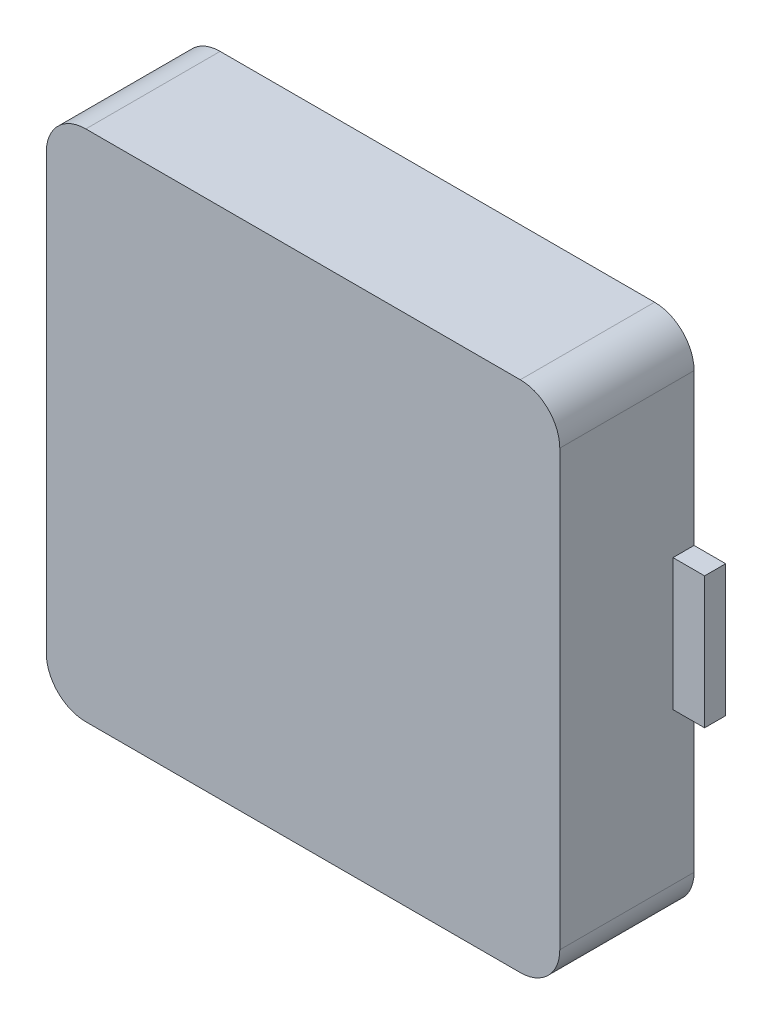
ISO-10303-21;
HEADER;
FILE_DESCRIPTION(('STEP AP214'),'2;1');
FILE_NAME('part.step','',(''),(''),'','','');
FILE_SCHEMA(('AUTOMOTIVE_DESIGN { 1 0 10303 214 1 1 1 1 }'));
ENDSEC;
DATA;
#1=APPLICATION_CONTEXT('core data for automotive mechanical design processes');
#2=APPLICATION_PROTOCOL_DEFINITION('international standard','automotive_design',2000,#1);
#3=PRODUCT_CONTEXT('',#1,'mechanical');
#4=PRODUCT('Part','Part','',(#3));
#5=PRODUCT_RELATED_PRODUCT_CATEGORY('part','',(#4));
#6=PRODUCT_DEFINITION_FORMATION('','',#4);
#7=PRODUCT_DEFINITION_CONTEXT('part definition',#1,'design');
#8=PRODUCT_DEFINITION('design','',#6,#7);
#9=PRODUCT_DEFINITION_SHAPE('','',#8);
#10=(LENGTH_UNIT() NAMED_UNIT(*) SI_UNIT(.MILLI.,.METRE.));
#11=(NAMED_UNIT(*) PLANE_ANGLE_UNIT() SI_UNIT($,.RADIAN.));
#12=(NAMED_UNIT(*) SI_UNIT($,.STERADIAN.) SOLID_ANGLE_UNIT());
#13=UNCERTAINTY_MEASURE_WITH_UNIT(LENGTH_MEASURE(1.E-05),#10,'distance_accuracy_value','');
#14=(GEOMETRIC_REPRESENTATION_CONTEXT(3) GLOBAL_UNCERTAINTY_ASSIGNED_CONTEXT((#13)) GLOBAL_UNIT_ASSIGNED_CONTEXT((#10,
#11,#12)) REPRESENTATION_CONTEXT('',''));
#15=CARTESIAN_POINT('',(0.,0.,0.));
#16=DIRECTION('',(0.,0.,1.));
#17=DIRECTION('',(1.,0.,0.));
#18=AXIS2_PLACEMENT_3D('',#15,#16,#17);
#19=CARTESIAN_POINT('',(0.,0.,0.));
#20=DIRECTION('',(0.,0.,-1.));
#21=DIRECTION('',(-1.,0.,0.));
#22=AXIS2_PLACEMENT_3D('',#19,#20,#21);
#23=CONICAL_SURFACE('',#22,3.15,0.0222185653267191);
#24=CARTESIAN_POINT('',(0.,0.,-4.5));
#25=DIRECTION('',(0.,0.,1.));
#26=DIRECTION('',(1.,0.,0.));
#27=AXIS2_PLACEMENT_3D('',#24,#25,#26);
#28=CIRCLE('',#27,3.25);
#29=CARTESIAN_POINT('',(3.25,0.,-4.5));
#30=VERTEX_POINT('',#29);
#31=EDGE_CURVE('E283',#30,#30,#28,.T.);
#32=ORIENTED_EDGE('',*,*,#31,.F.);
#33=EDGE_LOOP('',(#32));
#34=FACE_BOUND('',#33,.T.);
#35=CARTESIAN_POINT('',(0.,0.,0.));
#36=DIRECTION('',(0.,0.,1.));
#37=DIRECTION('',(1.,0.,0.));
#38=AXIS2_PLACEMENT_3D('',#35,#36,#37);
#39=CIRCLE('',#38,3.15);
#40=CARTESIAN_POINT('',(3.15,0.,0.));
#41=VERTEX_POINT('',#40);
#42=EDGE_CURVE('E286',#41,#41,#39,.T.);
#43=ORIENTED_EDGE('',*,*,#42,.T.);
#44=EDGE_LOOP('',(#43));
#45=FACE_BOUND('',#44,.T.);
#46=ADVANCED_FACE('F37',(#34,#45),#23,.F.);
#47=CARTESIAN_POINT('',(0.,3.25,-4.5));
#48=DIRECTION('',(0.,0.,1.));
#49=DIRECTION('',(1.,0.,0.));
#50=AXIS2_PLACEMENT_3D('',#47,#48,#49);
#51=PLANE('',#50);
#52=DIRECTION('',(0.,-1.,0.));
#53=VECTOR('',#52,1.);
#54=CARTESIAN_POINT('',(9.75,9.75,-4.5));
#55=LINE('',#54,#53);
#56=CARTESIAN_POINT('',(9.75,8.25,-4.5));
#57=VERTEX_POINT('',#56);
#58=CARTESIAN_POINT('',(9.75,2.5,-4.5));
#59=VERTEX_POINT('',#58);
#60=EDGE_CURVE('E270',#57,#59,#55,.T.);
#61=ORIENTED_EDGE('',*,*,#60,.T.);
#62=DIRECTION('',(1.,0.,0.));
#63=VECTOR('',#62,1.);
#64=CARTESIAN_POINT('',(9.75,2.5,-4.5));
#65=LINE('',#64,#63);
#66=CARTESIAN_POINT('',(10.95,2.5,-4.5));
#67=VERTEX_POINT('',#66);
#68=EDGE_CURVE('E233',#59,#67,#65,.T.);
#69=ORIENTED_EDGE('',*,*,#68,.T.);
#70=DIRECTION('',(0.,-1.,0.));
#71=VECTOR('',#70,1.);
#72=CARTESIAN_POINT('',(10.95,2.5,-4.5));
#73=LINE('',#72,#71);
#74=CARTESIAN_POINT('',(10.95,-2.5,-4.5));
#75=VERTEX_POINT('',#74);
#76=EDGE_CURVE('E256',#67,#75,#73,.T.);
#77=ORIENTED_EDGE('',*,*,#76,.T.);
#78=DIRECTION('',(-1.,0.,0.));
#79=VECTOR('',#78,1.);
#80=CARTESIAN_POINT('',(9.75,-2.5,-4.5));
#81=LINE('',#80,#79);
#82=CARTESIAN_POINT('',(9.75,-2.5,-4.5));
#83=VERTEX_POINT('',#82);
#84=EDGE_CURVE('E244',#75,#83,#81,.T.);
#85=ORIENTED_EDGE('',*,*,#84,.T.);
#86=CARTESIAN_POINT('',(9.75,-8.25,-4.5));
#87=VERTEX_POINT('',#86);
#88=EDGE_CURVE('E263',#83,#87,#55,.T.);
#89=ORIENTED_EDGE('',*,*,#88,.T.);
#90=CARTESIAN_POINT('',(8.25,-8.25,-4.5));
#91=DIRECTION('',(0.,0.,1.));
#92=DIRECTION('',(1.,0.,0.));
#93=AXIS2_PLACEMENT_3D('',#90,#91,#92);
#94=CIRCLE('',#93,1.5);
#95=CARTESIAN_POINT('',(8.25,-9.75,-4.5));
#96=VERTEX_POINT('',#95);
#97=EDGE_CURVE('E312',#87,#96,#94,.F.);
#98=ORIENTED_EDGE('',*,*,#97,.T.);
#99=DIRECTION('',(-1.,0.,0.));
#100=VECTOR('',#99,1.);
#101=CARTESIAN_POINT('',(9.75,-9.75,-4.5));
#102=LINE('',#101,#100);
#103=CARTESIAN_POINT('',(-8.25,-9.75,-4.5));
#104=VERTEX_POINT('',#103);
#105=EDGE_CURVE('E273',#96,#104,#102,.T.);
#106=ORIENTED_EDGE('',*,*,#105,.T.);
#107=CARTESIAN_POINT('',(-8.25,-8.25,-4.5));
#108=DIRECTION('',(0.,0.,1.));
#109=DIRECTION('',(1.,0.,0.));
#110=AXIS2_PLACEMENT_3D('',#107,#108,#109);
#111=CIRCLE('',#110,1.5);
#112=CARTESIAN_POINT('',(-9.75,-8.25,-4.5));
#113=VERTEX_POINT('',#112);
#114=EDGE_CURVE('E310',#104,#113,#111,.F.);
#115=ORIENTED_EDGE('',*,*,#114,.T.);
#116=DIRECTION('',(0.,1.,0.));
#117=VECTOR('',#116,1.);
#118=CARTESIAN_POINT('',(-9.75,-9.75,-4.5));
#119=LINE('',#118,#117);
#120=CARTESIAN_POINT('',(-9.75,-7.5,-4.5));
#121=VERTEX_POINT('',#120);
#122=EDGE_CURVE('E277',#113,#121,#119,.T.);
#123=ORIENTED_EDGE('',*,*,#122,.T.);
#124=DIRECTION('',(-1.,0.,0.));
#125=VECTOR('',#124,1.);
#126=CARTESIAN_POINT('',(-9.75,-7.5,-4.5));
#127=LINE('',#126,#125);
#128=CARTESIAN_POINT('',(-10.95,-7.5,-4.5));
#129=VERTEX_POINT('',#128);
#130=EDGE_CURVE('E179',#121,#129,#127,.T.);
#131=ORIENTED_EDGE('',*,*,#130,.T.);
#132=DIRECTION('',(0.,1.,0.));
#133=VECTOR('',#132,1.);
#134=CARTESIAN_POINT('',(-10.95,-3.5,-4.5));
#135=LINE('',#134,#133);
#136=CARTESIAN_POINT('',(-10.95,-3.5,-4.5));
#137=VERTEX_POINT('',#136);
#138=EDGE_CURVE('E201',#129,#137,#135,.T.);
#139=ORIENTED_EDGE('',*,*,#138,.T.);
#140=DIRECTION('',(1.,0.,0.));
#141=VECTOR('',#140,1.);
#142=CARTESIAN_POINT('',(-9.75,-3.5,-4.5));
#143=LINE('',#142,#141);
#144=CARTESIAN_POINT('',(-9.75,-3.5,-4.5));
#145=VERTEX_POINT('',#144);
#146=EDGE_CURVE('E52',#137,#145,#143,.T.);
#147=ORIENTED_EDGE('',*,*,#146,.T.);
#148=CARTESIAN_POINT('',(-9.75,3.5,-4.5));
#149=VERTEX_POINT('',#148);
#150=EDGE_CURVE('E280',#145,#149,#119,.T.);
#151=ORIENTED_EDGE('',*,*,#150,.T.);
#152=DIRECTION('',(-1.,0.,0.));
#153=VECTOR('',#152,1.);
#154=CARTESIAN_POINT('',(-9.75,3.5,-4.5));
#155=LINE('',#154,#153);
#156=CARTESIAN_POINT('',(-10.95,3.5,-4.5));
#157=VERTEX_POINT('',#156);
#158=EDGE_CURVE('E209',#149,#157,#155,.T.);
#159=ORIENTED_EDGE('',*,*,#158,.T.);
#160=DIRECTION('',(0.,1.,0.));
#161=VECTOR('',#160,1.);
#162=CARTESIAN_POINT('',(-10.95,7.5,-4.5));
#163=LINE('',#162,#161);
#164=CARTESIAN_POINT('',(-10.95,7.5,-4.5));
#165=VERTEX_POINT('',#164);
#166=EDGE_CURVE('E228',#157,#165,#163,.T.);
#167=ORIENTED_EDGE('',*,*,#166,.T.);
#168=DIRECTION('',(1.,0.,0.));
#169=VECTOR('',#168,1.);
#170=CARTESIAN_POINT('',(-9.75,7.5,-4.5));
#171=LINE('',#170,#169);
#172=CARTESIAN_POINT('',(-9.75,7.5,-4.5));
#173=VERTEX_POINT('',#172);
#174=EDGE_CURVE('E59',#165,#173,#171,.T.);
#175=ORIENTED_EDGE('',*,*,#174,.T.);
#176=CARTESIAN_POINT('',(-9.75,8.25,-4.5));
#177=VERTEX_POINT('',#176);
#178=EDGE_CURVE('E276',#173,#177,#119,.T.);
#179=ORIENTED_EDGE('',*,*,#178,.T.);
#180=CARTESIAN_POINT('',(-8.25,8.25,-4.5));
#181=DIRECTION('',(0.,0.,1.));
#182=DIRECTION('',(1.,0.,0.));
#183=AXIS2_PLACEMENT_3D('',#180,#181,#182);
#184=CIRCLE('',#183,1.5);
#185=CARTESIAN_POINT('',(-8.25,9.75,-4.5));
#186=VERTEX_POINT('',#185);
#187=EDGE_CURVE('E308',#177,#186,#184,.F.);
#188=ORIENTED_EDGE('',*,*,#187,.T.);
#189=DIRECTION('',(1.,0.,0.));
#190=VECTOR('',#189,1.);
#191=CARTESIAN_POINT('',(-9.75,9.75,-4.5));
#192=LINE('',#191,#190);
#193=CARTESIAN_POINT('',(8.25,9.75,-4.5));
#194=VERTEX_POINT('',#193);
#195=EDGE_CURVE('E279',#186,#194,#192,.T.);
#196=ORIENTED_EDGE('',*,*,#195,.T.);
#197=CARTESIAN_POINT('',(8.25,8.25,-4.5));
#198=DIRECTION('',(0.,0.,1.));
#199=DIRECTION('',(1.,0.,0.));
#200=AXIS2_PLACEMENT_3D('',#197,#198,#199);
#201=CIRCLE('',#200,1.5);
#202=EDGE_CURVE('E306',#194,#57,#201,.F.);
#203=ORIENTED_EDGE('',*,*,#202,.T.);
#204=EDGE_LOOP('',(#61,#69,#77,#85,#89,#98,#106,#115,#123,#131,#139,#147,#151,#159,#167,#175,
#179,#188,#196,#203));
#205=FACE_BOUND('',#204,.T.);
#206=ORIENTED_EDGE('',*,*,#31,.T.);
#207=EDGE_LOOP('',(#206));
#208=FACE_BOUND('',#207,.T.);
#209=ADVANCED_FACE('F340',(#205,#208),#51,.F.);
#210=CARTESIAN_POINT('',(0.,0.,0.));
#211=DIRECTION('',(0.,0.,-1.));
#212=DIRECTION('',(-1.,0.,0.));
#213=AXIS2_PLACEMENT_3D('',#210,#211,#212);
#214=PLANE('',#213);
#215=ORIENTED_EDGE('',*,*,#42,.F.);
#216=EDGE_LOOP('',(#215));
#217=FACE_BOUND('',#216,.T.);
#218=ADVANCED_FACE('F389',(#217),#214,.T.);
#219=CARTESIAN_POINT('',(0.,0.,0.6));
#220=DIRECTION('',(0.,0.,-1.));
#221=DIRECTION('',(-1.,0.,0.));
#222=AXIS2_PLACEMENT_3D('',#219,#220,#221);
#223=PLANE('',#222);
#224=DIRECTION('',(1.,0.,0.));
#225=VECTOR('',#224,1.);
#226=CARTESIAN_POINT('',(-9.75,-9.75,0.6));
#227=LINE('',#226,#225);
#228=CARTESIAN_POINT('',(-8.25,-9.75,0.6));
#229=VERTEX_POINT('',#228);
#230=CARTESIAN_POINT('',(8.25,-9.75,0.6));
#231=VERTEX_POINT('',#230);
#232=EDGE_CURVE('E298',#229,#231,#227,.T.);
#233=ORIENTED_EDGE('',*,*,#232,.T.);
#234=CARTESIAN_POINT('',(8.25,-8.25,0.6));
#235=DIRECTION('',(0.,0.,-1.));
#236=DIRECTION('',(-1.,0.,0.));
#237=AXIS2_PLACEMENT_3D('',#234,#235,#236);
#238=CIRCLE('',#237,1.5);
#239=CARTESIAN_POINT('',(9.75,-8.25,0.6));
#240=VERTEX_POINT('',#239);
#241=EDGE_CURVE('E325',#231,#240,#238,.F.);
#242=ORIENTED_EDGE('',*,*,#241,.T.);
#243=DIRECTION('',(0.,1.,0.));
#244=VECTOR('',#243,1.);
#245=CARTESIAN_POINT('',(9.75,-9.75,0.6));
#246=LINE('',#245,#244);
#247=CARTESIAN_POINT('',(9.75,8.25,0.6));
#248=VERTEX_POINT('',#247);
#249=EDGE_CURVE('E289',#240,#248,#246,.T.);
#250=ORIENTED_EDGE('',*,*,#249,.T.);
#251=CARTESIAN_POINT('',(8.25,8.25,0.6));
#252=DIRECTION('',(0.,0.,-1.));
#253=DIRECTION('',(-1.,0.,0.));
#254=AXIS2_PLACEMENT_3D('',#251,#252,#253);
#255=CIRCLE('',#254,1.5);
#256=CARTESIAN_POINT('',(8.25,9.75,0.6));
#257=VERTEX_POINT('',#256);
#258=EDGE_CURVE('E319',#248,#257,#255,.F.);
#259=ORIENTED_EDGE('',*,*,#258,.T.);
#260=DIRECTION('',(-1.,0.,0.));
#261=VECTOR('',#260,1.);
#262=CARTESIAN_POINT('',(-9.75,9.75,0.6));
#263=LINE('',#262,#261);
#264=CARTESIAN_POINT('',(-8.25,9.75,0.6));
#265=VERTEX_POINT('',#264);
#266=EDGE_CURVE('E292',#257,#265,#263,.T.);
#267=ORIENTED_EDGE('',*,*,#266,.T.);
#268=CARTESIAN_POINT('',(-8.25,8.25,0.6));
#269=DIRECTION('',(0.,0.,-1.));
#270=DIRECTION('',(-1.,0.,0.));
#271=AXIS2_PLACEMENT_3D('',#268,#269,#270);
#272=CIRCLE('',#271,1.5);
#273=CARTESIAN_POINT('',(-9.75,8.25,0.6));
#274=VERTEX_POINT('',#273);
#275=EDGE_CURVE('E321',#265,#274,#272,.F.);
#276=ORIENTED_EDGE('',*,*,#275,.T.);
#277=DIRECTION('',(0.,-1.,0.));
#278=VECTOR('',#277,1.);
#279=CARTESIAN_POINT('',(-9.75,-9.75,0.6));
#280=LINE('',#279,#278);
#281=CARTESIAN_POINT('',(-9.75,-8.25,0.6));
#282=VERTEX_POINT('',#281);
#283=EDGE_CURVE('E295',#274,#282,#280,.T.);
#284=ORIENTED_EDGE('',*,*,#283,.T.);
#285=CARTESIAN_POINT('',(-8.25,-8.25,0.6));
#286=DIRECTION('',(0.,0.,-1.));
#287=DIRECTION('',(-1.,0.,0.));
#288=AXIS2_PLACEMENT_3D('',#285,#286,#287);
#289=CIRCLE('',#288,1.5);
#290=EDGE_CURVE('E323',#282,#229,#289,.F.);
#291=ORIENTED_EDGE('',*,*,#290,.T.);
#292=EDGE_LOOP('',(#233,#242,#250,#259,#267,#276,#284,#291));
#293=FACE_BOUND('',#292,.T.);
#294=ADVANCED_FACE('F354',(#293),#223,.F.);
#295=CARTESIAN_POINT('',(-9.75,9.75,0.6));
#296=DIRECTION('',(0.,-1.,0.));
#297=DIRECTION('',(0.,0.,-1.));
#298=AXIS2_PLACEMENT_3D('',#295,#296,#297);
#299=PLANE('',#298);
#300=ORIENTED_EDGE('',*,*,#195,.F.);
#301=DIRECTION('',(0.,0.,-1.));
#302=VECTOR('',#301,1.);
#303=CARTESIAN_POINT('',(-8.25,9.75,0.6));
#304=LINE('',#303,#302);
#305=EDGE_CURVE('E11',#186,#265,#304,.F.);
#306=ORIENTED_EDGE('',*,*,#305,.T.);
#307=ORIENTED_EDGE('',*,*,#266,.F.);
#308=DIRECTION('',(0.,0.,-1.));
#309=VECTOR('',#308,1.);
#310=CARTESIAN_POINT('',(8.25,9.75,0.6));
#311=LINE('',#310,#309);
#312=EDGE_CURVE('E45',#257,#194,#311,.T.);
#313=ORIENTED_EDGE('',*,*,#312,.T.);
#314=EDGE_LOOP('',(#300,#306,#307,#313));
#315=FACE_BOUND('',#314,.T.);
#316=ADVANCED_FACE('F336',(#315),#299,.F.);
#317=CARTESIAN_POINT('',(-9.75,-9.75,0.6));
#318=DIRECTION('',(1.,0.,0.));
#319=DIRECTION('',(0.,0.,-1.));
#320=AXIS2_PLACEMENT_3D('',#317,#318,#319);
#321=PLANE('',#320);
#322=ORIENTED_EDGE('',*,*,#150,.F.);
#323=DIRECTION('',(0.,0.,-1.));
#324=VECTOR('',#323,1.);
#325=CARTESIAN_POINT('',(-9.75,-3.5,-3.7));
#326=LINE('',#325,#324);
#327=CARTESIAN_POINT('',(-9.75,-3.5,-3.7));
#328=VERTEX_POINT('',#327);
#329=EDGE_CURVE('E199',#328,#145,#326,.T.);
#330=ORIENTED_EDGE('',*,*,#329,.F.);
#331=DIRECTION('',(0.,-1.,0.));
#332=VECTOR('',#331,1.);
#333=CARTESIAN_POINT('',(-9.75,-3.5,-3.7));
#334=LINE('',#333,#332);
#335=CARTESIAN_POINT('',(-9.75,-7.5,-3.7));
#336=VERTEX_POINT('',#335);
#337=EDGE_CURVE('E191',#328,#336,#334,.T.);
#338=ORIENTED_EDGE('',*,*,#337,.T.);
#339=DIRECTION('',(0.,0.,-1.));
#340=VECTOR('',#339,1.);
#341=CARTESIAN_POINT('',(-9.75,-7.5,-3.7));
#342=LINE('',#341,#340);
#343=EDGE_CURVE('E174',#336,#121,#342,.T.);
#344=ORIENTED_EDGE('',*,*,#343,.T.);
#345=ORIENTED_EDGE('',*,*,#122,.F.);
#346=DIRECTION('',(0.,0.,-1.));
#347=VECTOR('',#346,1.);
#348=CARTESIAN_POINT('',(-9.75,-8.25,0.6));
#349=LINE('',#348,#347);
#350=EDGE_CURVE('E330',#113,#282,#349,.F.);
#351=ORIENTED_EDGE('',*,*,#350,.T.);
#352=ORIENTED_EDGE('',*,*,#283,.F.);
#353=DIRECTION('',(0.,0.,-1.));
#354=VECTOR('',#353,1.);
#355=CARTESIAN_POINT('',(-9.75,8.25,0.6));
#356=LINE('',#355,#354);
#357=EDGE_CURVE('E327',#274,#177,#356,.T.);
#358=ORIENTED_EDGE('',*,*,#357,.T.);
#359=ORIENTED_EDGE('',*,*,#178,.F.);
#360=DIRECTION('',(0.,0.,-1.));
#361=VECTOR('',#360,1.);
#362=CARTESIAN_POINT('',(-9.75,7.5,-3.7));
#363=LINE('',#362,#361);
#364=CARTESIAN_POINT('',(-9.75,7.5,-3.7));
#365=VERTEX_POINT('',#364);
#366=EDGE_CURVE('E231',#365,#173,#363,.T.);
#367=ORIENTED_EDGE('',*,*,#366,.F.);
#368=DIRECTION('',(0.,-1.,0.));
#369=VECTOR('',#368,1.);
#370=CARTESIAN_POINT('',(-9.75,7.5,-3.7));
#371=LINE('',#370,#369);
#372=CARTESIAN_POINT('',(-9.75,3.5,-3.7));
#373=VERTEX_POINT('',#372);
#374=EDGE_CURVE('E213',#365,#373,#371,.T.);
#375=ORIENTED_EDGE('',*,*,#374,.T.);
#376=DIRECTION('',(0.,0.,-1.));
#377=VECTOR('',#376,1.);
#378=CARTESIAN_POINT('',(-9.75,3.5,-3.7));
#379=LINE('',#378,#377);
#380=EDGE_CURVE('E225',#373,#149,#379,.T.);
#381=ORIENTED_EDGE('',*,*,#380,.T.);
#382=EDGE_LOOP('',(#322,#330,#338,#344,#345,#351,#352,#358,#359,#367,#375,#381));
#383=FACE_BOUND('',#382,.T.);
#384=ADVANCED_FACE('F198',(#383),#321,.F.);
#385=CARTESIAN_POINT('',(-9.75,-9.75,0.6));
#386=DIRECTION('',(0.,1.,0.));
#387=DIRECTION('',(0.,0.,1.));
#388=AXIS2_PLACEMENT_3D('',#385,#386,#387);
#389=PLANE('',#388);
#390=ORIENTED_EDGE('',*,*,#105,.F.);
#391=DIRECTION('',(0.,0.,-1.));
#392=VECTOR('',#391,1.);
#393=CARTESIAN_POINT('',(8.25,-9.75,0.6));
#394=LINE('',#393,#392);
#395=EDGE_CURVE('E317',#96,#231,#394,.F.);
#396=ORIENTED_EDGE('',*,*,#395,.T.);
#397=ORIENTED_EDGE('',*,*,#232,.F.);
#398=DIRECTION('',(0.,0.,-1.));
#399=VECTOR('',#398,1.);
#400=CARTESIAN_POINT('',(-8.25,-9.75,0.6));
#401=LINE('',#400,#399);
#402=EDGE_CURVE('E314',#229,#104,#401,.T.);
#403=ORIENTED_EDGE('',*,*,#402,.T.);
#404=EDGE_LOOP('',(#390,#396,#397,#403));
#405=FACE_BOUND('',#404,.T.);
#406=ADVANCED_FACE('F361',(#405),#389,.F.);
#407=CARTESIAN_POINT('',(9.75,-9.75,0.6));
#408=DIRECTION('',(-1.,0.,0.));
#409=DIRECTION('',(0.,0.,1.));
#410=AXIS2_PLACEMENT_3D('',#407,#408,#409);
#411=PLANE('',#410);
#412=ORIENTED_EDGE('',*,*,#88,.F.);
#413=DIRECTION('',(0.,0.,-1.));
#414=VECTOR('',#413,1.);
#415=CARTESIAN_POINT('',(9.75,-2.5,-3.7));
#416=LINE('',#415,#414);
#417=CARTESIAN_POINT('',(9.75,-2.5,-3.7));
#418=VERTEX_POINT('',#417);
#419=EDGE_CURVE('E260',#418,#83,#416,.T.);
#420=ORIENTED_EDGE('',*,*,#419,.F.);
#421=DIRECTION('',(0.,1.,0.));
#422=VECTOR('',#421,1.);
#423=CARTESIAN_POINT('',(9.75,2.5,-3.7));
#424=LINE('',#423,#422);
#425=CARTESIAN_POINT('',(9.75,2.5,-3.7));
#426=VERTEX_POINT('',#425);
#427=EDGE_CURVE('E240',#418,#426,#424,.T.);
#428=ORIENTED_EDGE('',*,*,#427,.T.);
#429=DIRECTION('',(0.,0.,-1.));
#430=VECTOR('',#429,1.);
#431=CARTESIAN_POINT('',(9.75,2.5,-3.7));
#432=LINE('',#431,#430);
#433=EDGE_CURVE('E253',#426,#59,#432,.T.);
#434=ORIENTED_EDGE('',*,*,#433,.T.);
#435=ORIENTED_EDGE('',*,*,#60,.F.);
#436=DIRECTION('',(0.,0.,-1.));
#437=VECTOR('',#436,1.);
#438=CARTESIAN_POINT('',(9.75,8.25,0.6));
#439=LINE('',#438,#437);
#440=EDGE_CURVE('E301',#57,#248,#439,.F.);
#441=ORIENTED_EDGE('',*,*,#440,.T.);
#442=ORIENTED_EDGE('',*,*,#249,.F.);
#443=DIRECTION('',(0.,0.,-1.));
#444=VECTOR('',#443,1.);
#445=CARTESIAN_POINT('',(9.75,-8.25,0.6));
#446=LINE('',#445,#444);
#447=EDGE_CURVE('E303',#240,#87,#446,.T.);
#448=ORIENTED_EDGE('',*,*,#447,.T.);
#449=EDGE_LOOP('',(#412,#420,#428,#434,#435,#441,#442,#448));
#450=FACE_BOUND('',#449,.T.);
#451=ADVANCED_FACE('F371',(#450),#411,.F.);
#452=CARTESIAN_POINT('',(8.25,-8.25,0.6));
#453=DIRECTION('',(0.,0.,-1.));
#454=DIRECTION('',(-1.,0.,0.));
#455=AXIS2_PLACEMENT_3D('',#452,#453,#454);
#456=CYLINDRICAL_SURFACE('',#455,1.5);
#457=ORIENTED_EDGE('',*,*,#241,.F.);
#458=ORIENTED_EDGE('',*,*,#395,.F.);
#459=ORIENTED_EDGE('',*,*,#97,.F.);
#460=ORIENTED_EDGE('',*,*,#447,.F.);
#461=EDGE_LOOP('',(#457,#458,#459,#460));
#462=FACE_BOUND('',#461,.T.);
#463=ADVANCED_FACE('F368',(#462),#456,.T.);
#464=CARTESIAN_POINT('',(-8.25,-8.25,0.6));
#465=DIRECTION('',(0.,0.,-1.));
#466=DIRECTION('',(-1.,0.,0.));
#467=AXIS2_PLACEMENT_3D('',#464,#465,#466);
#468=CYLINDRICAL_SURFACE('',#467,1.5);
#469=ORIENTED_EDGE('',*,*,#290,.F.);
#470=ORIENTED_EDGE('',*,*,#350,.F.);
#471=ORIENTED_EDGE('',*,*,#114,.F.);
#472=ORIENTED_EDGE('',*,*,#402,.F.);
#473=EDGE_LOOP('',(#469,#470,#471,#472));
#474=FACE_BOUND('',#473,.T.);
#475=ADVANCED_FACE('F358',(#474),#468,.T.);
#476=CARTESIAN_POINT('',(-8.25,8.25,0.6));
#477=DIRECTION('',(0.,0.,-1.));
#478=DIRECTION('',(-1.,0.,0.));
#479=AXIS2_PLACEMENT_3D('',#476,#477,#478);
#480=CYLINDRICAL_SURFACE('',#479,1.5);
#481=ORIENTED_EDGE('',*,*,#275,.F.);
#482=ORIENTED_EDGE('',*,*,#305,.F.);
#483=ORIENTED_EDGE('',*,*,#187,.F.);
#484=ORIENTED_EDGE('',*,*,#357,.F.);
#485=EDGE_LOOP('',(#481,#482,#483,#484));
#486=FACE_BOUND('',#485,.T.);
#487=ADVANCED_FACE('F348',(#486),#480,.T.);
#488=CARTESIAN_POINT('',(8.25,8.25,0.6));
#489=DIRECTION('',(0.,0.,-1.));
#490=DIRECTION('',(-1.,0.,0.));
#491=AXIS2_PLACEMENT_3D('',#488,#489,#490);
#492=CYLINDRICAL_SURFACE('',#491,1.5);
#493=ORIENTED_EDGE('',*,*,#258,.F.);
#494=ORIENTED_EDGE('',*,*,#440,.F.);
#495=ORIENTED_EDGE('',*,*,#202,.F.);
#496=ORIENTED_EDGE('',*,*,#312,.F.);
#497=EDGE_LOOP('',(#493,#494,#495,#496));
#498=FACE_BOUND('',#497,.T.);
#499=ADVANCED_FACE('F39',(#498),#492,.T.);
#500=CARTESIAN_POINT('',(9.75,-2.5,-3.7));
#501=DIRECTION('',(0.,-1.,0.));
#502=DIRECTION('',(1.,0.,0.));
#503=AXIS2_PLACEMENT_3D('',#500,#501,#502);
#504=PLANE('',#503);
#505=ORIENTED_EDGE('',*,*,#84,.F.);
#506=DIRECTION('',(0.,0.,-1.));
#507=VECTOR('',#506,1.);
#508=CARTESIAN_POINT('',(10.95,-2.5,-3.7));
#509=LINE('',#508,#507);
#510=CARTESIAN_POINT('',(10.95,-2.5,-3.7));
#511=VERTEX_POINT('',#510);
#512=EDGE_CURVE('E264',#511,#75,#509,.T.);
#513=ORIENTED_EDGE('',*,*,#512,.F.);
#514=DIRECTION('',(-1.,0.,0.));
#515=VECTOR('',#514,1.);
#516=CARTESIAN_POINT('',(9.75,-2.5,-3.7));
#517=LINE('',#516,#515);
#518=EDGE_CURVE('E250',#511,#418,#517,.T.);
#519=ORIENTED_EDGE('',*,*,#518,.T.);
#520=ORIENTED_EDGE('',*,*,#419,.T.);
#521=EDGE_LOOP('',(#505,#513,#519,#520));
#522=FACE_BOUND('',#521,.T.);
#523=ADVANCED_FACE('F375',(#522),#504,.T.);
#524=CARTESIAN_POINT('',(10.95,2.5,-3.7));
#525=DIRECTION('',(1.,0.,0.));
#526=DIRECTION('',(0.,0.,-1.));
#527=AXIS2_PLACEMENT_3D('',#524,#525,#526);
#528=PLANE('',#527);
#529=ORIENTED_EDGE('',*,*,#76,.F.);
#530=DIRECTION('',(0.,0.,-1.));
#531=VECTOR('',#530,1.);
#532=CARTESIAN_POINT('',(10.95,2.5,-3.7));
#533=LINE('',#532,#531);
#534=CARTESIAN_POINT('',(10.95,2.5,-3.7));
#535=VERTEX_POINT('',#534);
#536=EDGE_CURVE('E266',#535,#67,#533,.T.);
#537=ORIENTED_EDGE('',*,*,#536,.F.);
#538=DIRECTION('',(0.,-1.,0.));
#539=VECTOR('',#538,1.);
#540=CARTESIAN_POINT('',(10.95,2.5,-3.7));
#541=LINE('',#540,#539);
#542=EDGE_CURVE('E247',#535,#511,#541,.T.);
#543=ORIENTED_EDGE('',*,*,#542,.T.);
#544=ORIENTED_EDGE('',*,*,#512,.T.);
#545=EDGE_LOOP('',(#529,#537,#543,#544));
#546=FACE_BOUND('',#545,.T.);
#547=ADVANCED_FACE('F380',(#546),#528,.T.);
#548=CARTESIAN_POINT('',(9.75,2.5,-3.7));
#549=DIRECTION('',(0.,1.,0.));
#550=DIRECTION('',(0.,0.,1.));
#551=AXIS2_PLACEMENT_3D('',#548,#549,#550);
#552=PLANE('',#551);
#553=ORIENTED_EDGE('',*,*,#68,.F.);
#554=ORIENTED_EDGE('',*,*,#433,.F.);
#555=DIRECTION('',(1.,0.,0.));
#556=VECTOR('',#555,1.);
#557=CARTESIAN_POINT('',(9.75,2.5,-3.7));
#558=LINE('',#557,#556);
#559=EDGE_CURVE('E243',#426,#535,#558,.T.);
#560=ORIENTED_EDGE('',*,*,#559,.T.);
#561=ORIENTED_EDGE('',*,*,#536,.T.);
#562=EDGE_LOOP('',(#553,#554,#560,#561));
#563=FACE_BOUND('',#562,.T.);
#564=ADVANCED_FACE('F463',(#563),#552,.T.);
#565=CARTESIAN_POINT('',(0.,0.,-3.7));
#566=DIRECTION('',(0.,0.,1.));
#567=DIRECTION('',(1.,0.,0.));
#568=AXIS2_PLACEMENT_3D('',#565,#566,#567);
#569=PLANE('',#568);
#570=ORIENTED_EDGE('',*,*,#427,.F.);
#571=ORIENTED_EDGE('',*,*,#518,.F.);
#572=ORIENTED_EDGE('',*,*,#542,.F.);
#573=ORIENTED_EDGE('',*,*,#559,.F.);
#574=EDGE_LOOP('',(#570,#571,#572,#573));
#575=FACE_BOUND('',#574,.T.);
#576=ADVANCED_FACE('F473',(#575),#569,.T.);
#577=CARTESIAN_POINT('',(-9.75,7.5,-3.7));
#578=DIRECTION('',(0.,1.,0.));
#579=DIRECTION('',(0.,0.,1.));
#580=AXIS2_PLACEMENT_3D('',#577,#578,#579);
#581=PLANE('',#580);
#582=ORIENTED_EDGE('',*,*,#174,.F.);
#583=DIRECTION('',(0.,0.,-1.));
#584=VECTOR('',#583,1.);
#585=CARTESIAN_POINT('',(-10.95,7.5,-3.7));
#586=LINE('',#585,#584);
#587=CARTESIAN_POINT('',(-10.95,7.5,-3.7));
#588=VERTEX_POINT('',#587);
#589=EDGE_CURVE('E234',#588,#165,#586,.T.);
#590=ORIENTED_EDGE('',*,*,#589,.F.);
#591=DIRECTION('',(1.,0.,0.));
#592=VECTOR('',#591,1.);
#593=CARTESIAN_POINT('',(-9.75,7.5,-3.7));
#594=LINE('',#593,#592);
#595=EDGE_CURVE('E222',#588,#365,#594,.T.);
#596=ORIENTED_EDGE('',*,*,#595,.T.);
#597=ORIENTED_EDGE('',*,*,#366,.T.);
#598=EDGE_LOOP('',(#582,#590,#596,#597));
#599=FACE_BOUND('',#598,.T.);
#600=ADVANCED_FACE('F482',(#599),#581,.T.);
#601=CARTESIAN_POINT('',(-10.95,7.5,-3.7));
#602=DIRECTION('',(-1.,0.,0.));
#603=DIRECTION('',(0.,0.,1.));
#604=AXIS2_PLACEMENT_3D('',#601,#602,#603);
#605=PLANE('',#604);
#606=ORIENTED_EDGE('',*,*,#166,.F.);
#607=DIRECTION('',(0.,0.,-1.));
#608=VECTOR('',#607,1.);
#609=CARTESIAN_POINT('',(-10.95,3.5,-3.7));
#610=LINE('',#609,#608);
#611=CARTESIAN_POINT('',(-10.95,3.5,-3.7));
#612=VERTEX_POINT('',#611);
#613=EDGE_CURVE('E236',#612,#157,#610,.T.);
#614=ORIENTED_EDGE('',*,*,#613,.F.);
#615=DIRECTION('',(0.,1.,0.));
#616=VECTOR('',#615,1.);
#617=CARTESIAN_POINT('',(-10.95,7.5,-3.7));
#618=LINE('',#617,#616);
#619=EDGE_CURVE('E219',#612,#588,#618,.T.);
#620=ORIENTED_EDGE('',*,*,#619,.T.);
#621=ORIENTED_EDGE('',*,*,#589,.T.);
#622=EDGE_LOOP('',(#606,#614,#620,#621));
#623=FACE_BOUND('',#622,.T.);
#624=ADVANCED_FACE('F492',(#623),#605,.T.);
#625=CARTESIAN_POINT('',(-9.75,3.5,-3.7));
#626=DIRECTION('',(0.,-1.,0.));
#627=DIRECTION('',(0.,0.,-1.));
#628=AXIS2_PLACEMENT_3D('',#625,#626,#627);
#629=PLANE('',#628);
#630=ORIENTED_EDGE('',*,*,#158,.F.);
#631=ORIENTED_EDGE('',*,*,#380,.F.);
#632=DIRECTION('',(-1.,0.,0.));
#633=VECTOR('',#632,1.);
#634=CARTESIAN_POINT('',(-9.75,3.5,-3.7));
#635=LINE('',#634,#633);
#636=EDGE_CURVE('E216',#373,#612,#635,.T.);
#637=ORIENTED_EDGE('',*,*,#636,.T.);
#638=ORIENTED_EDGE('',*,*,#613,.T.);
#639=EDGE_LOOP('',(#630,#631,#637,#638));
#640=FACE_BOUND('',#639,.T.);
#641=ADVANCED_FACE('F502',(#640),#629,.T.);
#642=CARTESIAN_POINT('',(0.,0.,-3.7));
#643=DIRECTION('',(0.,0.,-1.));
#644=DIRECTION('',(-1.,0.,0.));
#645=AXIS2_PLACEMENT_3D('',#642,#643,#644);
#646=PLANE('',#645);
#647=ORIENTED_EDGE('',*,*,#374,.F.);
#648=ORIENTED_EDGE('',*,*,#595,.F.);
#649=ORIENTED_EDGE('',*,*,#619,.F.);
#650=ORIENTED_EDGE('',*,*,#636,.F.);
#651=EDGE_LOOP('',(#647,#648,#649,#650));
#652=FACE_BOUND('',#651,.T.);
#653=ADVANCED_FACE('F512',(#652),#646,.F.);
#654=CARTESIAN_POINT('',(-9.75,-3.5,-3.7));
#655=DIRECTION('',(0.,1.,0.));
#656=DIRECTION('',(-1.,0.,0.));
#657=AXIS2_PLACEMENT_3D('',#654,#655,#656);
#658=PLANE('',#657);
#659=ORIENTED_EDGE('',*,*,#146,.F.);
#660=DIRECTION('',(0.,0.,-1.));
#661=VECTOR('',#660,1.);
#662=CARTESIAN_POINT('',(-10.95,-3.5,-3.7));
#663=LINE('',#662,#661);
#664=CARTESIAN_POINT('',(-10.95,-3.5,-3.7));
#665=VERTEX_POINT('',#664);
#666=EDGE_CURVE('E210',#665,#137,#663,.T.);
#667=ORIENTED_EDGE('',*,*,#666,.F.);
#668=DIRECTION('',(1.,0.,0.));
#669=VECTOR('',#668,1.);
#670=CARTESIAN_POINT('',(-9.75,-3.5,-3.7));
#671=LINE('',#670,#669);
#672=EDGE_CURVE('E185',#665,#328,#671,.T.);
#673=ORIENTED_EDGE('',*,*,#672,.T.);
#674=ORIENTED_EDGE('',*,*,#329,.T.);
#675=EDGE_LOOP('',(#659,#667,#673,#674));
#676=FACE_BOUND('',#675,.T.);
#677=ADVANCED_FACE('F522',(#676),#658,.T.);
#678=CARTESIAN_POINT('',(-10.95,-3.5,-3.7));
#679=DIRECTION('',(-1.,0.,0.));
#680=DIRECTION('',(0.,0.,1.));
#681=AXIS2_PLACEMENT_3D('',#678,#679,#680);
#682=PLANE('',#681);
#683=ORIENTED_EDGE('',*,*,#138,.F.);
#684=DIRECTION('',(0.,0.,-1.));
#685=VECTOR('',#684,1.);
#686=CARTESIAN_POINT('',(-10.95,-7.5,-3.7));
#687=LINE('',#686,#685);
#688=CARTESIAN_POINT('',(-10.95,-7.5,-3.7));
#689=VERTEX_POINT('',#688);
#690=EDGE_CURVE('E184',#689,#129,#687,.T.);
#691=ORIENTED_EDGE('',*,*,#690,.F.);
#692=DIRECTION('',(0.,1.,0.));
#693=VECTOR('',#692,1.);
#694=CARTESIAN_POINT('',(-10.95,-3.5,-3.7));
#695=LINE('',#694,#693);
#696=EDGE_CURVE('E194',#689,#665,#695,.T.);
#697=ORIENTED_EDGE('',*,*,#696,.T.);
#698=ORIENTED_EDGE('',*,*,#666,.T.);
#699=EDGE_LOOP('',(#683,#691,#697,#698));
#700=FACE_BOUND('',#699,.T.);
#701=ADVANCED_FACE('F532',(#700),#682,.T.);
#702=CARTESIAN_POINT('',(-9.75,-7.5,-3.7));
#703=DIRECTION('',(0.,-1.,0.));
#704=DIRECTION('',(1.,0.,0.));
#705=AXIS2_PLACEMENT_3D('',#702,#703,#704);
#706=PLANE('',#705);
#707=ORIENTED_EDGE('',*,*,#130,.F.);
#708=ORIENTED_EDGE('',*,*,#343,.F.);
#709=DIRECTION('',(-1.,0.,0.));
#710=VECTOR('',#709,1.);
#711=CARTESIAN_POINT('',(-9.75,-7.5,-3.7));
#712=LINE('',#711,#710);
#713=EDGE_CURVE('E177',#336,#689,#712,.T.);
#714=ORIENTED_EDGE('',*,*,#713,.T.);
#715=ORIENTED_EDGE('',*,*,#690,.T.);
#716=EDGE_LOOP('',(#707,#708,#714,#715));
#717=FACE_BOUND('',#716,.T.);
#718=ADVANCED_FACE('F176',(#717),#706,.T.);
#719=CARTESIAN_POINT('',(0.,0.,-3.7));
#720=DIRECTION('',(0.,0.,-1.));
#721=DIRECTION('',(-1.,0.,0.));
#722=AXIS2_PLACEMENT_3D('',#719,#720,#721);
#723=PLANE('',#722);
#724=ORIENTED_EDGE('',*,*,#337,.F.);
#725=ORIENTED_EDGE('',*,*,#672,.F.);
#726=ORIENTED_EDGE('',*,*,#696,.F.);
#727=ORIENTED_EDGE('',*,*,#713,.F.);
#728=EDGE_LOOP('',(#724,#725,#726,#727));
#729=FACE_BOUND('',#728,.T.);
#730=ADVANCED_FACE('F189',(#729),#723,.F.);
#731=CLOSED_SHELL('',(#46,#209,#218,#294,#316,#384,#406,#451,#463,#475,#487,#499,#523,#547,#564,
#576,#600,#624,#641,#653,#677,#701,#718,#730));
#732=MANIFOLD_SOLID_BREP('B2',#731);
#733=ADVANCED_BREP_SHAPE_REPRESENTATION('',(#18,#732),#14);
#734=SHAPE_DEFINITION_REPRESENTATION(#9,#733);
ENDSEC;
END-ISO-10303-21;
